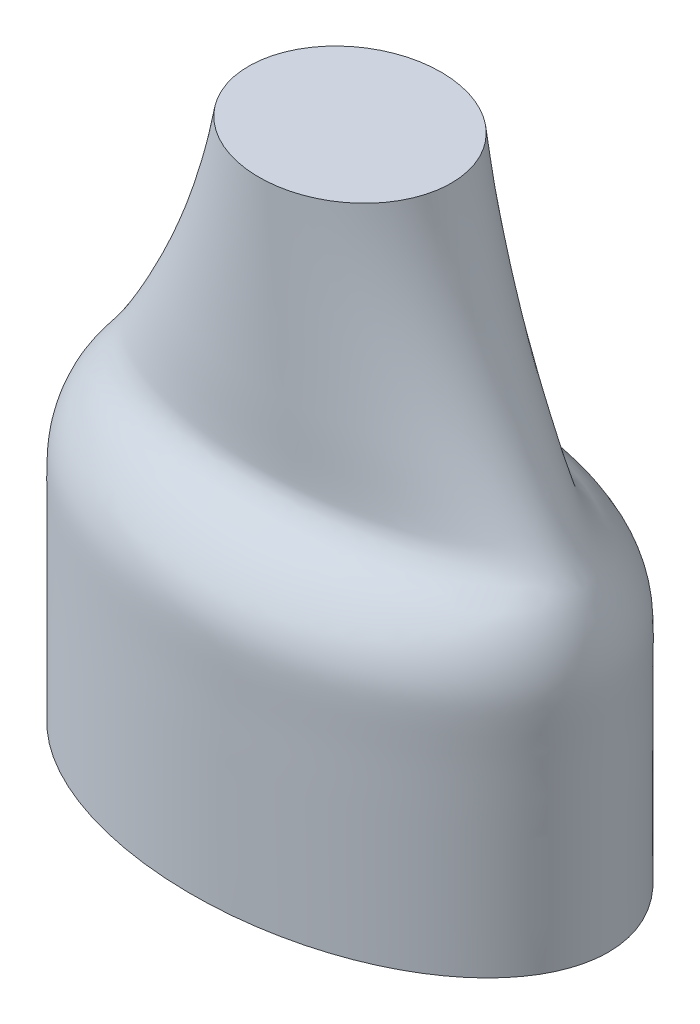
ISO-10303-21;
HEADER;
FILE_DESCRIPTION(('STEP AP214'),'2;1');
FILE_NAME('part.step','',(''),(''),'','','');
FILE_SCHEMA(('AUTOMOTIVE_DESIGN { 1 0 10303 214 1 1 1 1 }'));
ENDSEC;
DATA;
#1=APPLICATION_CONTEXT('core data for automotive mechanical design processes');
#2=APPLICATION_PROTOCOL_DEFINITION('international standard','automotive_design',2000,#1);
#3=PRODUCT_CONTEXT('',#1,'mechanical');
#4=PRODUCT('Part','Part','',(#3));
#5=PRODUCT_RELATED_PRODUCT_CATEGORY('part','',(#4));
#6=PRODUCT_DEFINITION_FORMATION('','',#4);
#7=PRODUCT_DEFINITION_CONTEXT('part definition',#1,'design');
#8=PRODUCT_DEFINITION('design','',#6,#7);
#9=PRODUCT_DEFINITION_SHAPE('','',#8);
#10=(LENGTH_UNIT() NAMED_UNIT(*) SI_UNIT(.MILLI.,.METRE.));
#11=(NAMED_UNIT(*) PLANE_ANGLE_UNIT() SI_UNIT($,.RADIAN.));
#12=(NAMED_UNIT(*) SI_UNIT($,.STERADIAN.) SOLID_ANGLE_UNIT());
#13=UNCERTAINTY_MEASURE_WITH_UNIT(LENGTH_MEASURE(1.E-05),#10,'distance_accuracy_value','');
#14=(GEOMETRIC_REPRESENTATION_CONTEXT(3) GLOBAL_UNCERTAINTY_ASSIGNED_CONTEXT((#13)) GLOBAL_UNIT_ASSIGNED_CONTEXT((#10,
#11,#12)) REPRESENTATION_CONTEXT('',''));
#15=CARTESIAN_POINT('',(0.,0.,0.));
#16=DIRECTION('',(0.,0.,1.));
#17=DIRECTION('',(1.,0.,0.));
#18=AXIS2_PLACEMENT_3D('',#15,#16,#17);
#19=CARTESIAN_POINT('',(0.,140.492925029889,0.));
#20=DIRECTION('',(0.,1.,0.));
#21=DIRECTION('',(0.,0.,1.));
#22=AXIS2_PLACEMENT_3D('',#19,#20,#21);
#23=PLANE('',#22);
#24=CARTESIAN_POINT('',(0.,140.492925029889,0.));
#25=DIRECTION('',(0.,1.,0.));
#26=DIRECTION('',(1.,0.,0.));
#27=AXIS2_PLACEMENT_3D('',#24,#25,#26);
#28=ELLIPSE('',#27,24.2293298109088,21.7798468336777);
#29=CARTESIAN_POINT('',(24.2293298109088,140.492925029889,0.));
#30=VERTEX_POINT('',#29);
#31=EDGE_CURVE('E80',#30,#30,#28,.T.);
#32=ORIENTED_EDGE('',*,*,#31,.T.);
#33=EDGE_LOOP('',(#32));
#34=FACE_BOUND('',#33,.T.);
#35=ADVANCED_FACE('F71',(#34),#23,.T.);
#36=CARTESIAN_POINT('',(0.,0.,0.));
#37=DIRECTION('',(0.,1.,0.));
#38=DIRECTION('',(0.,0.,1.));
#39=AXIS2_PLACEMENT_3D('',#36,#37,#38);
#40=PLANE('',#39);
#41=CARTESIAN_POINT('',(0.,0.,0.));
#42=DIRECTION('',(0.,1.,0.));
#43=DIRECTION('',(1.,0.,0.));
#44=AXIS2_PLACEMENT_3D('',#41,#42,#43);
#45=ELLIPSE('',#44,61.798753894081,37.8626168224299);
#46=CARTESIAN_POINT('',(61.798753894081,0.,0.));
#47=VERTEX_POINT('',#46);
#48=EDGE_CURVE('E12',#47,#47,#45,.T.);
#49=ORIENTED_EDGE('',*,*,#48,.F.);
#50=EDGE_LOOP('',(#49));
#51=FACE_BOUND('',#50,.T.);
#52=ADVANCED_FACE('F73',(#51),#40,.F.);
#53=CARTESIAN_POINT('',(61.7987538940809,0.,0.));
#54=CARTESIAN_POINT('',(61.7987598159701,1.67638472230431,0.));
#55=CARTESIAN_POINT('',(61.7987716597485,5.02915416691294,0.));
#56=CARTESIAN_POINT('',(61.7986659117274,11.0162448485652,0.));
#57=CARTESIAN_POINT('',(61.7993659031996,18.6797052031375,0.));
#58=CARTESIAN_POINT('',(61.7960893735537,27.3011745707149,0.));
#59=CARTESIAN_POINT('',(61.8071526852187,36.6408247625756,0.));
#60=CARTESIAN_POINT('',(61.761224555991,45.2630966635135,0.));
#61=CARTESIAN_POINT('',(61.8830361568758,52.5550394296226,-1.61329283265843E-13));
#62=CARTESIAN_POINT('',(61.6650314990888,57.541237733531,1.59594559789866E-13));
#63=CARTESIAN_POINT('',(61.197541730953,60.1421942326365,-1.00613961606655E-13));
#64=CARTESIAN_POINT('',(60.6240896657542,62.5306847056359,0.));
#65=CARTESIAN_POINT('',(59.9253842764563,64.7632755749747,0.));
#66=CARTESIAN_POINT('',(58.9863064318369,66.9856113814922,0.));
#67=CARTESIAN_POINT('',(57.9352413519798,69.1022821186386,0.));
#68=CARTESIAN_POINT('',(56.75268182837,71.1374751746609,0.));
#69=CARTESIAN_POINT('',(55.3116893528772,73.109372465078,0.));
#70=CARTESIAN_POINT('',(54.2528990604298,74.4552329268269,0.));
#71=CARTESIAN_POINT('',(53.3475663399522,75.664378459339,0.));
#72=CARTESIAN_POINT('',(52.409454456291,76.9581699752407,0.));
#73=CARTESIAN_POINT('',(51.3727540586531,78.4565504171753,0.));
#74=CARTESIAN_POINT('',(50.5031087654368,79.763525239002,0.));
#75=CARTESIAN_POINT('',(47.7489106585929,84.0831314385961,0.));
#76=CARTESIAN_POINT('',(43.8663301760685,90.706127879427,0.));
#77=CARTESIAN_POINT('',(38.6464968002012,100.732033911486,0.));
#78=CARTESIAN_POINT('',(34.3593078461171,110.147572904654,0.));
#79=CARTESIAN_POINT('',(30.221228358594,120.650459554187,0.));
#80=CARTESIAN_POINT('',(27.4350925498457,128.989812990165,0.));
#81=CARTESIAN_POINT('',(25.41711556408,135.925313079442,0.));
#82=CARTESIAN_POINT('',(24.6244220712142,138.973603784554,0.));
#83=CARTESIAN_POINT('',(24.2293298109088,140.492925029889,0.));
#84=CARTESIAN_POINT('',(61.798753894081,0.,-10.0415061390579));
#85=CARTESIAN_POINT('',(61.7987598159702,1.67638472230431,-10.0415083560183));
#86=CARTESIAN_POINT('',(61.7987716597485,5.02915416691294,-10.0415127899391));
#87=CARTESIAN_POINT('',(61.7986659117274,11.0162448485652,-10.0414732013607));
#88=CARTESIAN_POINT('',(61.7993659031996,18.6797052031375,-10.0417352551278));
#89=CARTESIAN_POINT('',(61.7960893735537,27.3011745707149,-10.0405086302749));
#90=CARTESIAN_POINT('',(61.8071526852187,36.6408247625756,-10.0446503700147));
#91=CARTESIAN_POINT('',(61.761224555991,45.2630966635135,-10.0274563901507));
#92=CARTESIAN_POINT('',(61.8830361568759,52.5550394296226,-10.0730586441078));
#93=CARTESIAN_POINT('',(61.6650314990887,57.541237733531,-9.99144487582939));
#94=CARTESIAN_POINT('',(61.197541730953,60.1421942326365,-9.81343956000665));
#95=CARTESIAN_POINT('',(60.6240896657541,62.5306847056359,-9.59053047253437));
#96=CARTESIAN_POINT('',(59.9253842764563,64.7632755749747,-9.31682326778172));
#97=CARTESIAN_POINT('',(58.9863064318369,66.9856113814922,-8.92213128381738));
#98=CARTESIAN_POINT('',(57.9352413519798,69.1022821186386,-8.47940372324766));
#99=CARTESIAN_POINT('',(56.75268182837,71.1374751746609,-7.80629583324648));
#100=CARTESIAN_POINT('',(55.3116893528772,73.109372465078,-7.44454091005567));
#101=CARTESIAN_POINT('',(54.2528990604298,74.4552329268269,-6.81328031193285));
#102=CARTESIAN_POINT('',(53.3475663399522,75.664378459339,-6.51194632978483));
#103=CARTESIAN_POINT('',(52.409454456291,76.9581699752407,-6.27048521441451));
#104=CARTESIAN_POINT('',(51.3727540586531,78.4565504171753,-6.1063891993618));
#105=CARTESIAN_POINT('',(50.5031087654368,79.763525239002,-6.02380434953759));
#106=CARTESIAN_POINT('',(47.7489106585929,84.0831314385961,-5.97454618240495));
#107=CARTESIAN_POINT('',(43.8663301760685,90.706127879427,-6.02174323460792));
#108=CARTESIAN_POINT('',(38.6464968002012,100.732033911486,-6.00663772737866));
#109=CARTESIAN_POINT('',(34.3593078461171,110.147572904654,-6.01112267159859));
#110=CARTESIAN_POINT('',(30.221228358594,120.650459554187,-6.01004761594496));
#111=CARTESIAN_POINT('',(27.4350925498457,128.989812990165,-6.01033973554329));
#112=CARTESIAN_POINT('',(25.41711556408,135.925313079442,-6.0103080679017));
#113=CARTESIAN_POINT('',(24.6244220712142,138.973603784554,-6.01031081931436));
#114=CARTESIAN_POINT('',(24.2293298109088,140.492925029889,-6.01031219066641));
#115=CARTESIAN_POINT('',(55.2875044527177,0.,-19.6724960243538));
#116=CARTESIAN_POINT('',(55.2875097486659,1.67638472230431,-19.6725003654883));
#117=CARTESIAN_POINT('',(55.2875203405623,5.02915416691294,-19.6725090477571));
#118=CARTESIAN_POINT('',(55.287425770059,11.0162448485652,-19.6724315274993));
#119=CARTESIAN_POINT('',(55.2880517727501,18.6797052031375,-19.6729446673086));
#120=CARTESIAN_POINT('',(55.2851215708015,27.3011745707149,-19.6705427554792));
#121=CARTESIAN_POINT('',(55.2950154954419,36.6408247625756,-19.6786528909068));
#122=CARTESIAN_POINT('',(55.2539419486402,45.2630966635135,-19.6449845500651));
#123=CARTESIAN_POINT('',(55.3628781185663,52.5550394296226,-19.7342804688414));
#124=CARTESIAN_POINT('',(55.1679164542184,57.541237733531,-19.5744687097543));
#125=CARTESIAN_POINT('',(54.7495436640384,60.1421942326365,-19.2255857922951));
#126=CARTESIAN_POINT('',(54.2367840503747,62.5306847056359,-18.7891739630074));
#127=CARTESIAN_POINT('',(53.6085466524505,64.7632755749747,-18.2495563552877));
#128=CARTESIAN_POINT('',(52.7777702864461,66.9856113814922,-17.4863907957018));
#129=CARTESIAN_POINT('',(51.8159372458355,69.1022821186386,-16.5958596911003));
#130=CARTESIAN_POINT('',(50.9571283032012,71.1374751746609,-15.4917317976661));
#131=CARTESIAN_POINT('',(49.0503241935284,73.109372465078,-14.117562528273));
#132=CARTESIAN_POINT('',(48.1844665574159,74.4552329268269,-12.9955536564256));
#133=CARTESIAN_POINT('',(47.3668402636,75.664378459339,-12.4062642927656));
#134=CARTESIAN_POINT('',(46.5396759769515,76.9581699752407,-11.9524505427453));
#135=CARTESIAN_POINT('',(45.6176071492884,78.4565504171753,-11.6380555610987));
#136=CARTESIAN_POINT('',(44.8457471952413,79.763525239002,-11.4810542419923));
#137=CARTESIAN_POINT('',(42.3998599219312,84.0831314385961,-11.3869334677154));
#138=CARTESIAN_POINT('',(38.9524197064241,90.706127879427,-11.4771159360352));
#139=CARTESIAN_POINT('',(34.3172517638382,100.732033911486,-11.4482528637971));
#140=CARTESIAN_POINT('',(30.5103389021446,110.147572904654,-11.4568225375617));
#141=CARTESIAN_POINT('',(26.8358074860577,120.650459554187,-11.4547683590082));
#142=CARTESIAN_POINT('',(24.3617793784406,128.989812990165,-11.4553265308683));
#143=CARTESIAN_POINT('',(22.569858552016,135.925313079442,-11.4552660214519));
#144=CARTESIAN_POINT('',(21.8659635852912,138.973603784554,-11.4552712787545));
#145=CARTESIAN_POINT('',(21.515130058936,140.492925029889,-11.4552738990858));
#146=CARTESIAN_POINT('',(32.1091314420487,0.,-33.8733301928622));
#147=CARTESIAN_POINT('',(32.1091345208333,1.67638472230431,-33.8733376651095));
#148=CARTESIAN_POINT('',(32.1091406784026,5.02915416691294,-33.8733526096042));
#149=CARTESIAN_POINT('',(32.109085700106,11.0162448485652,-33.8732191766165));
#150=CARTESIAN_POINT('',(32.1094496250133,18.6797052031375,-33.8741024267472));
#151=CARTESIAN_POINT('',(32.1077461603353,27.3011745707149,-33.8699680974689));
#152=CARTESIAN_POINT('',(32.1134979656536,36.6408247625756,-33.8839277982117));
#153=CARTESIAN_POINT('',(32.0896199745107,45.2630966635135,-33.8259756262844));
#154=CARTESIAN_POINT('',(32.1529497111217,52.5550394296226,-33.9796776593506));
#155=CARTESIAN_POINT('',(32.0396092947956,57.541237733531,-33.7045991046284));
#156=CARTESIAN_POINT('',(31.79684593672,60.1421942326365,-33.1036909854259));
#157=CARTESIAN_POINT('',(31.4986332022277,62.5306847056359,-32.3526026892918));
#158=CARTESIAN_POINT('',(31.1386208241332,64.7632755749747,-31.4193755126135));
#159=CARTESIAN_POINT('',(30.6417302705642,66.9856113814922,-30.1174338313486));
#160=CARTESIAN_POINT('',(30.1162370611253,69.1022821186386,-28.5561932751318));
#161=CARTESIAN_POINT('',(29.3109476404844,71.1374751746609,-26.913057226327));
#162=CARTESIAN_POINT('',(29.154160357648,73.109372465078,-23.7467253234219));
#163=CARTESIAN_POINT('',(28.526051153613,74.4552329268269,-21.9527133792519));
#164=CARTESIAN_POINT('',(28.0630237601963,75.664378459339,-20.9393122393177));
#165=CARTESIAN_POINT('',(27.5640016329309,76.9581699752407,-20.1810400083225));
#166=CARTESIAN_POINT('',(27.0201796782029,78.4565504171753,-19.6482190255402));
#167=CARTESIAN_POINT('',(26.5624318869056,79.763525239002,-19.3836469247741));
#168=CARTESIAN_POINT('',(25.1140495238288,84.0831314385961,-19.2244480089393));
#169=CARTESIAN_POINT('',(23.071777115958,90.706127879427,-19.3769855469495));
#170=CARTESIAN_POINT('',(20.3264306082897,100.732033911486,-19.3281656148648));
#171=CARTESIAN_POINT('',(18.0715323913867,110.147572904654,-19.3426606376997));
#172=CARTESIAN_POINT('',(15.8950829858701,120.650459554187,-19.3391861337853));
#173=CARTESIAN_POINT('',(14.4296927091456,128.989812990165,-19.3401302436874));
#174=CARTESIAN_POINT('',(13.368322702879,135.925313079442,-19.3400278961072));
#175=CARTESIAN_POINT('',(12.951399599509,138.973603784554,-19.3400367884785));
#176=CARTESIAN_POINT('',(12.7435978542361,140.492925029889,-19.3400412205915));
#177=CARTESIAN_POINT('',(16.3895847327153,0.,-37.8626168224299));
#178=CARTESIAN_POINT('',(16.3895863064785,1.67638472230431,-37.862625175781));
#179=CARTESIAN_POINT('',(16.3895894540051,5.02915416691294,-37.8626418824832));
#180=CARTESIAN_POINT('',(16.3895613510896,11.0162448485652,-37.8624927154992));
#181=CARTESIAN_POINT('',(16.3897473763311,18.6797052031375,-37.8634801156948));
#182=CARTESIAN_POINT('',(16.3888766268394,27.3011745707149,-37.8588582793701));
#183=CARTESIAN_POINT('',(16.391816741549,36.6408247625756,-37.8744640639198));
#184=CARTESIAN_POINT('',(16.3796111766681,45.2630966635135,-37.8096783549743));
#185=CARTESIAN_POINT('',(16.4119830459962,52.5550394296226,-37.98150444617));
#186=CARTESIAN_POINT('',(16.3540475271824,57.541237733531,-37.6739894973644));
#187=CARTESIAN_POINT('',(16.2302889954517,60.1421942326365,-37.0023878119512));
#188=CARTESIAN_POINT('',(16.077764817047,62.5306847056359,-36.1626945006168));
#189=CARTESIAN_POINT('',(15.8975448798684,64.7632755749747,-35.1212812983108));
#190=CARTESIAN_POINT('',(15.6333878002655,66.9856113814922,-33.6608952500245));
#191=CARTESIAN_POINT('',(15.3893561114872,69.1022821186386,-31.927540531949));
#192=CARTESIAN_POINT('',(14.7542748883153,71.1374751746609,-29.9820646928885));
#193=CARTESIAN_POINT('',(15.3690460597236,73.109372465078,-26.7803366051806));
#194=CARTESIAN_POINT('',(14.9568951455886,74.4552329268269,-24.7168659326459));
#195=CARTESIAN_POINT('',(14.7291913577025,75.664378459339,-23.5835784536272));
#196=CARTESIAN_POINT('',(14.4608550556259,76.9581699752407,-22.7262472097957));
#197=CARTESIAN_POINT('',(14.1771924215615,78.4565504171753,-22.1270803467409));
#198=CARTESIAN_POINT('',(13.9366155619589,79.763525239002,-21.8289188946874));
#199=CARTESIAN_POINT('',(13.176925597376,84.0831314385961,-21.6497630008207));
#200=CARTESIAN_POINT('',(12.1051614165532,90.706127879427,-21.8214224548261));
#201=CARTESIAN_POINT('',(10.664817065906,100.732033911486,-21.7664825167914));
#202=CARTESIAN_POINT('',(9.48170307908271,110.147572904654,-21.7827946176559));
#203=CARTESIAN_POINT('',(8.33977666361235,120.650459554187,-21.7788845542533));
#204=CARTESIAN_POINT('',(7.57091949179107,128.989812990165,-21.7799470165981));
#205=CARTESIAN_POINT('',(7.01404382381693,135.925313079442,-21.7798318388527));
#206=CARTESIAN_POINT('',(6.795294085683,138.973603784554,-21.7798418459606));
#207=CARTESIAN_POINT('',(6.68626540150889,140.492925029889,-21.7798468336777));
#208=CARTESIAN_POINT('',(-16.3895847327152,0.,-37.8626168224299));
#209=CARTESIAN_POINT('',(-16.3895863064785,1.67638472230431,-37.862625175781));
#210=CARTESIAN_POINT('',(-16.389589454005,5.02915416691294,-37.8626418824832));
#211=CARTESIAN_POINT('',(-16.3895613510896,11.0162448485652,-37.8624927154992));
#212=CARTESIAN_POINT('',(-16.3897473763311,18.6797052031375,-37.8634801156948));
#213=CARTESIAN_POINT('',(-16.3888766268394,27.3011745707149,-37.8588582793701));
#214=CARTESIAN_POINT('',(-16.391816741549,36.6408247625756,-37.8744640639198));
#215=CARTESIAN_POINT('',(-16.3796111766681,45.2630966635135,-37.8096783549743));
#216=CARTESIAN_POINT('',(-16.4119830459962,52.5550394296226,-37.98150444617));
#217=CARTESIAN_POINT('',(-16.3540475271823,57.541237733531,-37.6739894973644));
#218=CARTESIAN_POINT('',(-16.2302889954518,60.1421942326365,-37.0023878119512));
#219=CARTESIAN_POINT('',(-16.0777648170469,62.5306847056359,-36.1626945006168));
#220=CARTESIAN_POINT('',(-15.8975448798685,64.7632755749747,-35.1212812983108));
#221=CARTESIAN_POINT('',(-15.6333878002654,66.9856113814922,-33.6608952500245));
#222=CARTESIAN_POINT('',(-15.3893561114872,69.1022821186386,-31.927540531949));
#223=CARTESIAN_POINT('',(-14.7542748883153,71.1374751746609,-29.9820646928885));
#224=CARTESIAN_POINT('',(-15.3690460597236,73.109372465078,-26.7803366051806));
#225=CARTESIAN_POINT('',(-14.9568951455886,74.4552329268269,-24.7168659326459));
#226=CARTESIAN_POINT('',(-14.7291913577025,75.664378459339,-23.5835784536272));
#227=CARTESIAN_POINT('',(-14.4608550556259,76.9581699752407,-22.7262472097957));
#228=CARTESIAN_POINT('',(-14.1771924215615,78.4565504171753,-22.1270803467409));
#229=CARTESIAN_POINT('',(-13.9366155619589,79.763525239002,-21.8289188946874));
#230=CARTESIAN_POINT('',(-13.176925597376,84.0831314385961,-21.6497630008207));
#231=CARTESIAN_POINT('',(-12.1051614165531,90.706127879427,-21.8214224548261));
#232=CARTESIAN_POINT('',(-10.664817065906,100.732033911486,-21.7664825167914));
#233=CARTESIAN_POINT('',(-9.48170307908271,110.147572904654,-21.7827946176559));
#234=CARTESIAN_POINT('',(-8.33977666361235,120.650459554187,-21.7788845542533));
#235=CARTESIAN_POINT('',(-7.57091949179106,128.989812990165,-21.7799470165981));
#236=CARTESIAN_POINT('',(-7.01404382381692,135.925313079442,-21.7798318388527));
#237=CARTESIAN_POINT('',(-6.795294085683,138.973603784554,-21.7798418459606));
#238=CARTESIAN_POINT('',(-6.68626540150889,140.492925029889,-21.7798468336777));
#239=CARTESIAN_POINT('',(-32.1091314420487,0.,-33.8733301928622));
#240=CARTESIAN_POINT('',(-32.1091345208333,1.67638472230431,-33.8733376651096));
#241=CARTESIAN_POINT('',(-32.1091406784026,5.02915416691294,-33.8733526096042));
#242=CARTESIAN_POINT('',(-32.1090857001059,11.0162448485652,-33.8732191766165));
#243=CARTESIAN_POINT('',(-32.1094496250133,18.6797052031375,-33.8741024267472));
#244=CARTESIAN_POINT('',(-32.1077461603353,27.3011745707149,-33.8699680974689));
#245=CARTESIAN_POINT('',(-32.1134979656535,36.6408247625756,-33.8839277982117));
#246=CARTESIAN_POINT('',(-32.0896199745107,45.2630966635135,-33.8259756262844));
#247=CARTESIAN_POINT('',(-32.1529497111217,52.5550394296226,-33.9796776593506));
#248=CARTESIAN_POINT('',(-32.0396092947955,57.541237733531,-33.7045991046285));
#249=CARTESIAN_POINT('',(-31.7968459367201,60.1421942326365,-33.1036909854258));
#250=CARTESIAN_POINT('',(-31.4986332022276,62.5306847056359,-32.3526026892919));
#251=CARTESIAN_POINT('',(-31.1386208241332,64.7632755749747,-31.4193755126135));
#252=CARTESIAN_POINT('',(-30.6417302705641,66.9856113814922,-30.1174338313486));
#253=CARTESIAN_POINT('',(-30.1162370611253,69.1022821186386,-28.5561932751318));
#254=CARTESIAN_POINT('',(-29.3109476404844,71.1374751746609,-26.913057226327));
#255=CARTESIAN_POINT('',(-29.154160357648,73.109372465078,-23.7467253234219));
#256=CARTESIAN_POINT('',(-28.526051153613,74.4552329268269,-21.9527133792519));
#257=CARTESIAN_POINT('',(-28.0630237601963,75.664378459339,-20.9393122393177));
#258=CARTESIAN_POINT('',(-27.5640016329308,76.9581699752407,-20.1810400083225));
#259=CARTESIAN_POINT('',(-27.0201796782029,78.4565504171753,-19.6482190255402));
#260=CARTESIAN_POINT('',(-26.5624318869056,79.763525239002,-19.383646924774));
#261=CARTESIAN_POINT('',(-25.1140495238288,84.0831314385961,-19.2244480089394));
#262=CARTESIAN_POINT('',(-23.071777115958,90.706127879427,-19.3769855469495));
#263=CARTESIAN_POINT('',(-20.3264306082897,100.732033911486,-19.3281656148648));
#264=CARTESIAN_POINT('',(-18.0715323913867,110.147572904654,-19.3426606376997));
#265=CARTESIAN_POINT('',(-15.8950829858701,120.650459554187,-19.3391861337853));
#266=CARTESIAN_POINT('',(-14.4296927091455,128.989812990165,-19.3401302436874));
#267=CARTESIAN_POINT('',(-13.368322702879,135.925313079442,-19.3400278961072));
#268=CARTESIAN_POINT('',(-12.951399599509,138.973603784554,-19.3400367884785));
#269=CARTESIAN_POINT('',(-12.7435978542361,140.492925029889,-19.3400412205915));
#270=CARTESIAN_POINT('',(-55.2875044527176,0.,-19.6724960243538));
#271=CARTESIAN_POINT('',(-55.2875097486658,1.67638472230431,-19.6725003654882));
#272=CARTESIAN_POINT('',(-55.2875203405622,5.02915416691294,-19.6725090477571));
#273=CARTESIAN_POINT('',(-55.2874257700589,11.0162448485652,-19.6724315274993));
#274=CARTESIAN_POINT('',(-55.28805177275,18.6797052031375,-19.6729446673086));
#275=CARTESIAN_POINT('',(-55.2851215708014,27.3011745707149,-19.6705427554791));
#276=CARTESIAN_POINT('',(-55.2950154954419,36.6408247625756,-19.6786528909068));
#277=CARTESIAN_POINT('',(-55.2539419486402,45.2630966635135,-19.6449845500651));
#278=CARTESIAN_POINT('',(-55.3628781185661,52.5550394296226,-19.7342804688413));
#279=CARTESIAN_POINT('',(-55.1679164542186,57.541237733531,-19.5744687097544));
#280=CARTESIAN_POINT('',(-54.7495436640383,60.1421942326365,-19.225585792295));
#281=CARTESIAN_POINT('',(-54.2367840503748,62.5306847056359,-18.7891739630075));
#282=CARTESIAN_POINT('',(-53.6085466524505,64.7632755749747,-18.2495563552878));
#283=CARTESIAN_POINT('',(-52.777770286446,66.9856113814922,-17.4863907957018));
#284=CARTESIAN_POINT('',(-51.8159372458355,69.1022821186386,-16.5958596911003));
#285=CARTESIAN_POINT('',(-50.9571283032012,71.1374751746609,-15.4917317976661));
#286=CARTESIAN_POINT('',(-49.0503241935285,73.109372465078,-14.117562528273));
#287=CARTESIAN_POINT('',(-48.1844665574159,74.4552329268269,-12.9955536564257));
#288=CARTESIAN_POINT('',(-47.3668402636,75.664378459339,-12.4062642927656));
#289=CARTESIAN_POINT('',(-46.5396759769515,76.9581699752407,-11.9524505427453));
#290=CARTESIAN_POINT('',(-45.6176071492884,78.4565504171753,-11.6380555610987));
#291=CARTESIAN_POINT('',(-44.8457471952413,79.763525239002,-11.4810542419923));
#292=CARTESIAN_POINT('',(-42.3998599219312,84.0831314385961,-11.3869334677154));
#293=CARTESIAN_POINT('',(-38.9524197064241,90.706127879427,-11.4771159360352));
#294=CARTESIAN_POINT('',(-34.3172517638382,100.732033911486,-11.4482528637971));
#295=CARTESIAN_POINT('',(-30.5103389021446,110.147572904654,-11.4568225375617));
#296=CARTESIAN_POINT('',(-26.8358074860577,120.650459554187,-11.4547683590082));
#297=CARTESIAN_POINT('',(-24.3617793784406,128.989812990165,-11.4553265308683));
#298=CARTESIAN_POINT('',(-22.569858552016,135.925313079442,-11.4552660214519));
#299=CARTESIAN_POINT('',(-21.8659635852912,138.973603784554,-11.4552712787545));
#300=CARTESIAN_POINT('',(-21.515130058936,140.492925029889,-11.4552738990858));
#301=CARTESIAN_POINT('',(-61.7987538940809,0.,-10.0415061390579));
#302=CARTESIAN_POINT('',(-61.7987598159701,1.67638472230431,-10.0415083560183));
#303=CARTESIAN_POINT('',(-61.7987716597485,5.02915416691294,-10.0415127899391));
#304=CARTESIAN_POINT('',(-61.7986659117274,11.0162448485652,-10.0414732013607));
#305=CARTESIAN_POINT('',(-61.7993659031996,18.6797052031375,-10.0417352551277));
#306=CARTESIAN_POINT('',(-61.7960893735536,27.3011745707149,-10.0405086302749));
#307=CARTESIAN_POINT('',(-61.8071526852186,36.6408247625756,-10.0446503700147));
#308=CARTESIAN_POINT('',(-61.761224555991,45.2630966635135,-10.0274563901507));
#309=CARTESIAN_POINT('',(-61.8830361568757,52.5550394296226,-10.0730586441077));
#310=CARTESIAN_POINT('',(-61.6650314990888,57.541237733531,-9.99144487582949));
#311=CARTESIAN_POINT('',(-61.197541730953,60.1421942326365,-9.81343956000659));
#312=CARTESIAN_POINT('',(-60.6240896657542,62.5306847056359,-9.59053047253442));
#313=CARTESIAN_POINT('',(-59.9253842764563,64.7632755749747,-9.31682326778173));
#314=CARTESIAN_POINT('',(-58.9863064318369,66.9856113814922,-8.9221312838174));
#315=CARTESIAN_POINT('',(-57.9352413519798,69.1022821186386,-8.47940372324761));
#316=CARTESIAN_POINT('',(-56.75268182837,71.1374751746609,-7.80629583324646));
#317=CARTESIAN_POINT('',(-55.3116893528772,73.109372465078,-7.44454091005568));
#318=CARTESIAN_POINT('',(-54.2528990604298,74.4552329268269,-6.81328031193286));
#319=CARTESIAN_POINT('',(-53.3475663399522,75.664378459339,-6.51194632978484));
#320=CARTESIAN_POINT('',(-52.409454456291,76.9581699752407,-6.27048521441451));
#321=CARTESIAN_POINT('',(-51.3727540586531,78.4565504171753,-6.10638919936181));
#322=CARTESIAN_POINT('',(-50.5031087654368,79.763525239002,-6.0238043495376));
#323=CARTESIAN_POINT('',(-47.7489106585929,84.0831314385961,-5.97454618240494));
#324=CARTESIAN_POINT('',(-43.8663301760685,90.706127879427,-6.02174323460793));
#325=CARTESIAN_POINT('',(-38.6464968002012,100.732033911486,-6.00663772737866));
#326=CARTESIAN_POINT('',(-34.3593078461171,110.147572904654,-6.0111226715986));
#327=CARTESIAN_POINT('',(-30.221228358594,120.650459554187,-6.01004761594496));
#328=CARTESIAN_POINT('',(-27.4350925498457,128.989812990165,-6.01033973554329));
#329=CARTESIAN_POINT('',(-25.41711556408,135.925313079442,-6.0103080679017));
#330=CARTESIAN_POINT('',(-24.6244220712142,138.973603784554,-6.01031081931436));
#331=CARTESIAN_POINT('',(-24.2293298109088,140.492925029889,-6.01031219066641));
#332=CARTESIAN_POINT('',(-61.7987538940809,0.,10.0415061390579));
#333=CARTESIAN_POINT('',(-61.7987598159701,1.67638472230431,10.0415083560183));
#334=CARTESIAN_POINT('',(-61.7987716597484,5.02915416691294,10.0415127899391));
#335=CARTESIAN_POINT('',(-61.7986659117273,11.0162448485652,10.0414732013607));
#336=CARTESIAN_POINT('',(-61.7993659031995,18.6797052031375,10.0417352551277));
#337=CARTESIAN_POINT('',(-61.7960893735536,27.3011745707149,10.0405086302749));
#338=CARTESIAN_POINT('',(-61.8071526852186,36.6408247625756,10.0446503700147));
#339=CARTESIAN_POINT('',(-61.761224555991,45.2630966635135,10.0274563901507));
#340=CARTESIAN_POINT('',(-61.8830361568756,52.5550394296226,10.0730586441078));
#341=CARTESIAN_POINT('',(-61.6650314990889,57.541237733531,9.99144487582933));
#342=CARTESIAN_POINT('',(-61.1975417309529,60.1421942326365,9.81343956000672));
#343=CARTESIAN_POINT('',(-60.6240896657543,62.5306847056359,9.59053047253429));
#344=CARTESIAN_POINT('',(-59.9253842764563,64.7632755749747,9.31682326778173));
#345=CARTESIAN_POINT('',(-58.986306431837,66.9856113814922,8.92213128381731));
#346=CARTESIAN_POINT('',(-57.9352413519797,69.1022821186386,8.47940372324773));
#347=CARTESIAN_POINT('',(-56.75268182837,71.1374751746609,7.80629583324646));
#348=CARTESIAN_POINT('',(-55.3116893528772,73.109372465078,7.44454091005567));
#349=CARTESIAN_POINT('',(-54.2528990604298,74.4552329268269,6.81328031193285));
#350=CARTESIAN_POINT('',(-53.3475663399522,75.664378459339,6.51194632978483));
#351=CARTESIAN_POINT('',(-52.409454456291,76.9581699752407,6.27048521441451));
#352=CARTESIAN_POINT('',(-51.3727540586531,78.4565504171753,6.10638919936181));
#353=CARTESIAN_POINT('',(-50.5031087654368,79.763525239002,6.02380434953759));
#354=CARTESIAN_POINT('',(-47.7489106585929,84.0831314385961,5.97454618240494));
#355=CARTESIAN_POINT('',(-43.8663301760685,90.706127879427,6.02174323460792));
#356=CARTESIAN_POINT('',(-38.6464968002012,100.732033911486,6.00663772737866));
#357=CARTESIAN_POINT('',(-34.3593078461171,110.147572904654,6.01112267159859));
#358=CARTESIAN_POINT('',(-30.221228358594,120.650459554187,6.01004761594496));
#359=CARTESIAN_POINT('',(-27.4350925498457,128.989812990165,6.01033973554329));
#360=CARTESIAN_POINT('',(-25.41711556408,135.925313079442,6.0103080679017));
#361=CARTESIAN_POINT('',(-24.6244220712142,138.973603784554,6.01031081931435));
#362=CARTESIAN_POINT('',(-24.2293298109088,140.492925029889,6.0103121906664));
#363=CARTESIAN_POINT('',(-55.2875044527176,0.,19.6724960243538));
#364=CARTESIAN_POINT('',(-55.2875097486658,1.67638472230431,19.6725003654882));
#365=CARTESIAN_POINT('',(-55.2875203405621,5.02915416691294,19.6725090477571));
#366=CARTESIAN_POINT('',(-55.2874257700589,11.0162448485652,19.6724315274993));
#367=CARTESIAN_POINT('',(-55.28805177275,18.6797052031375,19.6729446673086));
#368=CARTESIAN_POINT('',(-55.2851215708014,27.3011745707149,19.6705427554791));
#369=CARTESIAN_POINT('',(-55.2950154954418,36.6408247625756,19.6786528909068));
#370=CARTESIAN_POINT('',(-55.2539419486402,45.2630966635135,19.6449845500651));
#371=CARTESIAN_POINT('',(-55.3628781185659,52.5550394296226,19.7342804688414));
#372=CARTESIAN_POINT('',(-55.1679164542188,57.541237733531,19.5744687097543));
#373=CARTESIAN_POINT('',(-54.7495436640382,60.1421942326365,19.2255857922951));
#374=CARTESIAN_POINT('',(-54.2367840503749,62.5306847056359,18.7891739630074));
#375=CARTESIAN_POINT('',(-53.6085466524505,64.7632755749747,18.2495563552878));
#376=CARTESIAN_POINT('',(-52.7777702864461,66.9856113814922,17.4863907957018));
#377=CARTESIAN_POINT('',(-51.8159372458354,69.1022821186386,16.5958596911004));
#378=CARTESIAN_POINT('',(-50.9571283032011,71.1374751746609,15.4917317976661));
#379=CARTESIAN_POINT('',(-49.0503241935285,73.109372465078,14.117562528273));
#380=CARTESIAN_POINT('',(-48.1844665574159,74.4552329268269,12.9955536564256));
#381=CARTESIAN_POINT('',(-47.3668402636,75.664378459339,12.4062642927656));
#382=CARTESIAN_POINT('',(-46.5396759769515,76.9581699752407,11.9524505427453));
#383=CARTESIAN_POINT('',(-45.6176071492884,78.4565504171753,11.6380555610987));
#384=CARTESIAN_POINT('',(-44.8457471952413,79.763525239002,11.4810542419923));
#385=CARTESIAN_POINT('',(-42.3998599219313,84.0831314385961,11.3869334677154));
#386=CARTESIAN_POINT('',(-38.9524197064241,90.706127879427,11.4771159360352));
#387=CARTESIAN_POINT('',(-34.3172517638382,100.732033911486,11.4482528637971));
#388=CARTESIAN_POINT('',(-30.5103389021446,110.147572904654,11.4568225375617));
#389=CARTESIAN_POINT('',(-26.8358074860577,120.650459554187,11.4547683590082));
#390=CARTESIAN_POINT('',(-24.3617793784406,128.989812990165,11.4553265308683));
#391=CARTESIAN_POINT('',(-22.5698585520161,135.925313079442,11.4552660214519));
#392=CARTESIAN_POINT('',(-21.8659635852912,138.973603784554,11.4552712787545));
#393=CARTESIAN_POINT('',(-21.515130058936,140.492925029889,11.4552738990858));
#394=CARTESIAN_POINT('',(-32.1091314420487,0.,33.8733301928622));
#395=CARTESIAN_POINT('',(-32.1091345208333,1.67638472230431,33.8733376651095));
#396=CARTESIAN_POINT('',(-32.1091406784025,5.02915416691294,33.8733526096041));
#397=CARTESIAN_POINT('',(-32.1090857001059,11.0162448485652,33.8732191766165));
#398=CARTESIAN_POINT('',(-32.1094496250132,18.6797052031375,33.8741024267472));
#399=CARTESIAN_POINT('',(-32.1077461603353,27.3011745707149,33.8699680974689));
#400=CARTESIAN_POINT('',(-32.1134979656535,36.6408247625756,33.8839277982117));
#401=CARTESIAN_POINT('',(-32.0896199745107,45.2630966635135,33.8259756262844));
#402=CARTESIAN_POINT('',(-32.1529497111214,52.5550394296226,33.9796776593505));
#403=CARTESIAN_POINT('',(-32.0396092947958,57.541237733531,33.7045991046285));
#404=CARTESIAN_POINT('',(-31.7968459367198,60.1421942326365,33.1036909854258));
#405=CARTESIAN_POINT('',(-31.4986332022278,62.5306847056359,32.3526026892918));
#406=CARTESIAN_POINT('',(-31.1386208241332,64.7632755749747,31.4193755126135));
#407=CARTESIAN_POINT('',(-30.6417302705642,66.9856113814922,30.1174338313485));
#408=CARTESIAN_POINT('',(-30.1162370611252,69.1022821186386,28.5561932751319));
#409=CARTESIAN_POINT('',(-29.3109476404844,71.1374751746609,26.913057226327));
#410=CARTESIAN_POINT('',(-29.154160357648,73.109372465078,23.7467253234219));
#411=CARTESIAN_POINT('',(-28.526051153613,74.4552329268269,21.9527133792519));
#412=CARTESIAN_POINT('',(-28.0630237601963,75.664378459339,20.9393122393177));
#413=CARTESIAN_POINT('',(-27.5640016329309,76.9581699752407,20.1810400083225));
#414=CARTESIAN_POINT('',(-27.0201796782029,78.4565504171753,19.6482190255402));
#415=CARTESIAN_POINT('',(-26.5624318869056,79.763525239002,19.383646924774));
#416=CARTESIAN_POINT('',(-25.1140495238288,84.0831314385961,19.2244480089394));
#417=CARTESIAN_POINT('',(-23.071777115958,90.706127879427,19.3769855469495));
#418=CARTESIAN_POINT('',(-20.3264306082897,100.732033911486,19.3281656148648));
#419=CARTESIAN_POINT('',(-18.0715323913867,110.147572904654,19.3426606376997));
#420=CARTESIAN_POINT('',(-15.8950829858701,120.650459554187,19.3391861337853));
#421=CARTESIAN_POINT('',(-14.4296927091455,128.989812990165,19.3401302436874));
#422=CARTESIAN_POINT('',(-13.368322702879,135.925313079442,19.3400278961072));
#423=CARTESIAN_POINT('',(-12.951399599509,138.973603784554,19.3400367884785));
#424=CARTESIAN_POINT('',(-12.7435978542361,140.492925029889,19.3400412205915));
#425=CARTESIAN_POINT('',(-16.3895847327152,0.,37.8626168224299));
#426=CARTESIAN_POINT('',(-16.3895863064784,1.67638472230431,37.862625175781));
#427=CARTESIAN_POINT('',(-16.389589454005,5.02915416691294,37.8626418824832));
#428=CARTESIAN_POINT('',(-16.3895613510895,11.0162448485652,37.8624927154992));
#429=CARTESIAN_POINT('',(-16.389747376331,18.6797052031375,37.8634801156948));
#430=CARTESIAN_POINT('',(-16.3888766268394,27.3011745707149,37.85885827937));
#431=CARTESIAN_POINT('',(-16.3918167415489,36.6408247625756,37.8744640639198));
#432=CARTESIAN_POINT('',(-16.3796111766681,45.2630966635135,37.8096783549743));
#433=CARTESIAN_POINT('',(-16.4119830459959,52.5550394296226,37.9815044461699));
#434=CARTESIAN_POINT('',(-16.3540475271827,57.541237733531,37.6739894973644));
#435=CARTESIAN_POINT('',(-16.2302889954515,60.1421942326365,37.0023878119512));
#436=CARTESIAN_POINT('',(-16.0777648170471,62.5306847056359,36.1626945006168));
#437=CARTESIAN_POINT('',(-15.8975448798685,64.7632755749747,35.1212812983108));
#438=CARTESIAN_POINT('',(-15.6333878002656,66.9856113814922,33.6608952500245));
#439=CARTESIAN_POINT('',(-15.3893561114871,69.1022821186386,31.927540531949));
#440=CARTESIAN_POINT('',(-14.7542748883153,71.1374751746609,29.9820646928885));
#441=CARTESIAN_POINT('',(-15.3690460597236,73.109372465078,26.7803366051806));
#442=CARTESIAN_POINT('',(-14.9568951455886,74.4552329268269,24.7168659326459));
#443=CARTESIAN_POINT('',(-14.7291913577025,75.664378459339,23.5835784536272));
#444=CARTESIAN_POINT('',(-14.4608550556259,76.9581699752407,22.7262472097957));
#445=CARTESIAN_POINT('',(-14.1771924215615,78.4565504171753,22.1270803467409));
#446=CARTESIAN_POINT('',(-13.9366155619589,79.763525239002,21.8289188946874));
#447=CARTESIAN_POINT('',(-13.176925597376,84.0831314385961,21.6497630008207));
#448=CARTESIAN_POINT('',(-12.1051614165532,90.706127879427,21.8214224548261));
#449=CARTESIAN_POINT('',(-10.664817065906,100.732033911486,21.7664825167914));
#450=CARTESIAN_POINT('',(-9.48170307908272,110.147572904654,21.7827946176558));
#451=CARTESIAN_POINT('',(-8.33977666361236,120.650459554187,21.7788845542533));
#452=CARTESIAN_POINT('',(-7.57091949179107,128.989812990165,21.7799470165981));
#453=CARTESIAN_POINT('',(-7.01404382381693,135.925313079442,21.7798318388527));
#454=CARTESIAN_POINT('',(-6.79529408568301,138.973603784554,21.7798418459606));
#455=CARTESIAN_POINT('',(-6.6862654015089,140.492925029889,21.7798468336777));
#456=CARTESIAN_POINT('',(16.3895847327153,0.,37.8626168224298));
#457=CARTESIAN_POINT('',(16.3895863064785,1.67638472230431,37.8626251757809));
#458=CARTESIAN_POINT('',(16.3895894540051,5.02915416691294,37.8626418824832));
#459=CARTESIAN_POINT('',(16.3895613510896,11.0162448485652,37.8624927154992));
#460=CARTESIAN_POINT('',(16.3897473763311,18.6797052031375,37.8634801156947));
#461=CARTESIAN_POINT('',(16.3888766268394,27.3011745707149,37.85885827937));
#462=CARTESIAN_POINT('',(16.391816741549,36.6408247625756,37.8744640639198));
#463=CARTESIAN_POINT('',(16.379611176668,45.2630966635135,37.8096783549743));
#464=CARTESIAN_POINT('',(16.4119830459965,52.5550394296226,37.9815044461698));
#465=CARTESIAN_POINT('',(16.3540475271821,57.541237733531,37.6739894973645));
#466=CARTESIAN_POINT('',(16.2302889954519,60.1421942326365,37.0023878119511));
#467=CARTESIAN_POINT('',(16.0777648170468,62.5306847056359,36.1626945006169));
#468=CARTESIAN_POINT('',(15.8975448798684,64.7632755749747,35.1212812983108));
#469=CARTESIAN_POINT('',(15.6333878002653,66.9856113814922,33.6608952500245));
#470=CARTESIAN_POINT('',(15.3893561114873,69.1022821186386,31.927540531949));
#471=CARTESIAN_POINT('',(14.7542748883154,71.1374751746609,29.9820646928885));
#472=CARTESIAN_POINT('',(15.3690460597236,73.109372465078,26.7803366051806));
#473=CARTESIAN_POINT('',(14.9568951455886,74.4552329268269,24.7168659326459));
#474=CARTESIAN_POINT('',(14.7291913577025,75.664378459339,23.5835784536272));
#475=CARTESIAN_POINT('',(14.4608550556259,76.9581699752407,22.7262472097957));
#476=CARTESIAN_POINT('',(14.1771924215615,78.4565504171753,22.1270803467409));
#477=CARTESIAN_POINT('',(13.9366155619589,79.763525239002,21.8289188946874));
#478=CARTESIAN_POINT('',(13.176925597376,84.0831314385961,21.6497630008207));
#479=CARTESIAN_POINT('',(12.1051614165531,90.706127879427,21.8214224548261));
#480=CARTESIAN_POINT('',(10.664817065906,100.732033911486,21.7664825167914));
#481=CARTESIAN_POINT('',(9.4817030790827,110.147572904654,21.7827946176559));
#482=CARTESIAN_POINT('',(8.33977666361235,120.650459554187,21.7788845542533));
#483=CARTESIAN_POINT('',(7.57091949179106,128.989812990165,21.7799470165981));
#484=CARTESIAN_POINT('',(7.01404382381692,135.925313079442,21.7798318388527));
#485=CARTESIAN_POINT('',(6.79529408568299,138.973603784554,21.7798418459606));
#486=CARTESIAN_POINT('',(6.68626540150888,140.492925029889,21.7798468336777));
#487=CARTESIAN_POINT('',(32.1091314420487,0.,33.8733301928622));
#488=CARTESIAN_POINT('',(32.1091345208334,1.67638472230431,33.8733376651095));
#489=CARTESIAN_POINT('',(32.1091406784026,5.02915416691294,33.8733526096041));
#490=CARTESIAN_POINT('',(32.109085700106,11.0162448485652,33.8732191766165));
#491=CARTESIAN_POINT('',(32.1094496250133,18.6797052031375,33.8741024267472));
#492=CARTESIAN_POINT('',(32.1077461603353,27.3011745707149,33.8699680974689));
#493=CARTESIAN_POINT('',(32.1134979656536,36.6408247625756,33.8839277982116));
#494=CARTESIAN_POINT('',(32.0896199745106,45.2630966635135,33.8259756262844));
#495=CARTESIAN_POINT('',(32.1529497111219,52.5550394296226,33.9796776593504));
#496=CARTESIAN_POINT('',(32.0396092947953,57.541237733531,33.7045991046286));
#497=CARTESIAN_POINT('',(31.7968459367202,60.1421942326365,33.1036909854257));
#498=CARTESIAN_POINT('',(31.4986332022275,62.5306847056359,32.3526026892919));
#499=CARTESIAN_POINT('',(31.1386208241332,64.7632755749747,31.4193755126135));
#500=CARTESIAN_POINT('',(30.641730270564,66.9856113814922,30.1174338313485));
#501=CARTESIAN_POINT('',(30.1162370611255,69.1022821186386,28.5561932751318));
#502=CARTESIAN_POINT('',(29.3109476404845,71.1374751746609,26.913057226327));
#503=CARTESIAN_POINT('',(29.154160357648,73.109372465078,23.7467253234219));
#504=CARTESIAN_POINT('',(28.526051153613,74.4552329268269,21.9527133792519));
#505=CARTESIAN_POINT('',(28.0630237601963,75.664378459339,20.9393122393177));
#506=CARTESIAN_POINT('',(27.5640016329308,76.9581699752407,20.1810400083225));
#507=CARTESIAN_POINT('',(27.0201796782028,78.4565504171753,19.6482190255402));
#508=CARTESIAN_POINT('',(26.5624318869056,79.763525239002,19.3836469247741));
#509=CARTESIAN_POINT('',(25.1140495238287,84.0831314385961,19.2244480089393));
#510=CARTESIAN_POINT('',(23.071777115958,90.706127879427,19.3769855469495));
#511=CARTESIAN_POINT('',(20.3264306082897,100.732033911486,19.3281656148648));
#512=CARTESIAN_POINT('',(18.0715323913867,110.147572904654,19.3426606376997));
#513=CARTESIAN_POINT('',(15.8950829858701,120.650459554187,19.3391861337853));
#514=CARTESIAN_POINT('',(14.4296927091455,128.989812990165,19.3401302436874));
#515=CARTESIAN_POINT('',(13.368322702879,135.925313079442,19.3400278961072));
#516=CARTESIAN_POINT('',(12.951399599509,138.973603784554,19.3400367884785));
#517=CARTESIAN_POINT('',(12.7435978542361,140.492925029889,19.3400412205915));
#518=CARTESIAN_POINT('',(55.2875044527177,0.,19.6724960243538));
#519=CARTESIAN_POINT('',(55.2875097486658,1.67638472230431,19.6725003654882));
#520=CARTESIAN_POINT('',(55.2875203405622,5.02915416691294,19.6725090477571));
#521=CARTESIAN_POINT('',(55.287425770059,11.0162448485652,19.6724315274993));
#522=CARTESIAN_POINT('',(55.2880517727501,18.6797052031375,19.6729446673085));
#523=CARTESIAN_POINT('',(55.2851215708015,27.3011745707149,19.6705427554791));
#524=CARTESIAN_POINT('',(55.2950154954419,36.6408247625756,19.6786528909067));
#525=CARTESIAN_POINT('',(55.2539419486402,45.2630966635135,19.6449845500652));
#526=CARTESIAN_POINT('',(55.3628781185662,52.5550394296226,19.7342804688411));
#527=CARTESIAN_POINT('',(55.1679164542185,57.541237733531,19.5744687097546));
#528=CARTESIAN_POINT('',(54.7495436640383,60.1421942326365,19.2255857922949));
#529=CARTESIAN_POINT('',(54.2367840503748,62.5306847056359,18.7891739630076));
#530=CARTESIAN_POINT('',(53.6085466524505,64.7632755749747,18.2495563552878));
#531=CARTESIAN_POINT('',(52.7777702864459,66.9856113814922,17.4863907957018));
#532=CARTESIAN_POINT('',(51.8159372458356,69.1022821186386,16.5958596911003));
#533=CARTESIAN_POINT('',(50.9571283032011,71.1374751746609,15.4917317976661));
#534=CARTESIAN_POINT('',(49.0503241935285,73.109372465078,14.117562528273));
#535=CARTESIAN_POINT('',(48.1844665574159,74.4552329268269,12.9955536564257));
#536=CARTESIAN_POINT('',(47.3668402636,75.664378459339,12.4062642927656));
#537=CARTESIAN_POINT('',(46.5396759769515,76.9581699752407,11.9524505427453));
#538=CARTESIAN_POINT('',(45.6176071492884,78.4565504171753,11.6380555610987));
#539=CARTESIAN_POINT('',(44.8457471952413,79.763525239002,11.4810542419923));
#540=CARTESIAN_POINT('',(42.3998599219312,84.0831314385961,11.3869334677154));
#541=CARTESIAN_POINT('',(38.9524197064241,90.706127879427,11.4771159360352));
#542=CARTESIAN_POINT('',(34.3172517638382,100.732033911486,11.4482528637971));
#543=CARTESIAN_POINT('',(30.5103389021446,110.147572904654,11.4568225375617));
#544=CARTESIAN_POINT('',(26.8358074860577,120.650459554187,11.4547683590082));
#545=CARTESIAN_POINT('',(24.3617793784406,128.989812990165,11.4553265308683));
#546=CARTESIAN_POINT('',(22.5698585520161,135.925313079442,11.4552660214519));
#547=CARTESIAN_POINT('',(21.8659635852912,138.973603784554,11.4552712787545));
#548=CARTESIAN_POINT('',(21.515130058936,140.492925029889,11.4552738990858));
#549=CARTESIAN_POINT('',(61.7987538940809,0.,10.0415061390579));
#550=CARTESIAN_POINT('',(61.7987598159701,1.67638472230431,10.0415083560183));
#551=CARTESIAN_POINT('',(61.7987716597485,5.02915416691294,10.041512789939));
#552=CARTESIAN_POINT('',(61.7986659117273,11.0162448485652,10.0414732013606));
#553=CARTESIAN_POINT('',(61.7993659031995,18.6797052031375,10.0417352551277));
#554=CARTESIAN_POINT('',(61.7960893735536,27.3011745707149,10.0405086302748));
#555=CARTESIAN_POINT('',(61.8071526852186,36.6408247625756,10.0446503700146));
#556=CARTESIAN_POINT('',(61.761224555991,45.2630966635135,10.0274563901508));
#557=CARTESIAN_POINT('',(61.8830361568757,52.5550394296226,10.0730586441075));
#558=CARTESIAN_POINT('',(61.6650314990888,57.541237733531,9.99144487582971));
#559=CARTESIAN_POINT('',(61.197541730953,60.1421942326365,9.81343956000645));
#560=CARTESIAN_POINT('',(60.6240896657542,62.5306847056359,9.59053047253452));
#561=CARTESIAN_POINT('',(59.9253842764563,64.7632755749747,9.31682326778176));
#562=CARTESIAN_POINT('',(58.9863064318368,66.9856113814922,8.92213128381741));
#563=CARTESIAN_POINT('',(57.9352413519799,69.1022821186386,8.47940372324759));
#564=CARTESIAN_POINT('',(56.75268182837,71.1374751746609,7.80629583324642));
#565=CARTESIAN_POINT('',(55.3116893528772,73.109372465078,7.44454091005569));
#566=CARTESIAN_POINT('',(54.2528990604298,74.4552329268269,6.81328031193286));
#567=CARTESIAN_POINT('',(53.3475663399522,75.664378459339,6.51194632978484));
#568=CARTESIAN_POINT('',(52.409454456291,76.9581699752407,6.27048521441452));
#569=CARTESIAN_POINT('',(51.3727540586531,78.4565504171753,6.10638919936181));
#570=CARTESIAN_POINT('',(50.5031087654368,79.763525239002,6.0238043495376));
#571=CARTESIAN_POINT('',(47.7489106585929,84.0831314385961,5.97454618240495));
#572=CARTESIAN_POINT('',(43.8663301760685,90.706127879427,6.02174323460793));
#573=CARTESIAN_POINT('',(38.6464968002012,100.732033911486,6.00663772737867));
#574=CARTESIAN_POINT('',(34.3593078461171,110.147572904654,6.0111226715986));
#575=CARTESIAN_POINT('',(30.221228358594,120.650459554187,6.01004761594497));
#576=CARTESIAN_POINT('',(27.4350925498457,128.989812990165,6.0103397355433));
#577=CARTESIAN_POINT('',(25.41711556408,135.925313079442,6.0103080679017));
#578=CARTESIAN_POINT('',(24.6244220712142,138.973603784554,6.01031081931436));
#579=CARTESIAN_POINT('',(24.2293298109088,140.492925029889,6.01031219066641));
#580=CARTESIAN_POINT('',(61.7987538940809,0.,0.));
#581=CARTESIAN_POINT('',(61.7987598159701,1.67638472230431,0.));
#582=CARTESIAN_POINT('',(61.7987716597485,5.02915416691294,0.));
#583=CARTESIAN_POINT('',(61.7986659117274,11.0162448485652,0.));
#584=CARTESIAN_POINT('',(61.7993659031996,18.6797052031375,0.));
#585=CARTESIAN_POINT('',(61.7960893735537,27.3011745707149,0.));
#586=CARTESIAN_POINT('',(61.8071526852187,36.6408247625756,0.));
#587=CARTESIAN_POINT('',(61.761224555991,45.2630966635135,0.));
#588=CARTESIAN_POINT('',(61.8830361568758,52.5550394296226,-1.61329283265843E-13));
#589=CARTESIAN_POINT('',(61.6650314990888,57.541237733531,1.59594559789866E-13));
#590=CARTESIAN_POINT('',(61.197541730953,60.1421942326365,-1.00613961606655E-13));
#591=CARTESIAN_POINT('',(60.6240896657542,62.5306847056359,0.));
#592=CARTESIAN_POINT('',(59.9253842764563,64.7632755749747,0.));
#593=CARTESIAN_POINT('',(58.9863064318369,66.9856113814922,0.));
#594=CARTESIAN_POINT('',(57.9352413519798,69.1022821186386,0.));
#595=CARTESIAN_POINT('',(56.75268182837,71.1374751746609,0.));
#596=CARTESIAN_POINT('',(55.3116893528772,73.109372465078,0.));
#597=CARTESIAN_POINT('',(54.2528990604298,74.4552329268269,0.));
#598=CARTESIAN_POINT('',(53.3475663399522,75.664378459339,0.));
#599=CARTESIAN_POINT('',(52.409454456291,76.9581699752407,0.));
#600=CARTESIAN_POINT('',(51.3727540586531,78.4565504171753,0.));
#601=CARTESIAN_POINT('',(50.5031087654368,79.763525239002,0.));
#602=CARTESIAN_POINT('',(47.7489106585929,84.0831314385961,0.));
#603=CARTESIAN_POINT('',(43.8663301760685,90.706127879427,0.));
#604=CARTESIAN_POINT('',(38.6464968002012,100.732033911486,0.));
#605=CARTESIAN_POINT('',(34.3593078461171,110.147572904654,0.));
#606=CARTESIAN_POINT('',(30.221228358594,120.650459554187,0.));
#607=CARTESIAN_POINT('',(27.4350925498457,128.989812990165,0.));
#608=CARTESIAN_POINT('',(25.41711556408,135.925313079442,0.));
#609=CARTESIAN_POINT('',(24.6244220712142,138.973603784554,0.));
#610=CARTESIAN_POINT('',(24.2293298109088,140.492925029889,0.));
#611=B_SPLINE_SURFACE_WITH_KNOTS('',3,3,((#53,#54,#55,#56,#57,#58,#59,#60,#61,#62,#63,#64,#65,
#66,#67,#68,#69,#70,#71,#72,#73,#74,#75,#76,#77,#78,#79,#80,#81,#82,#83),(#84,#85,#86,#87,#88,
#89,#90,#91,#92,#93,#94,#95,#96,#97,#98,#99,#100,#101,#102,#103,#104,#105,#106,#107,#108,#109,
#110,#111,#112,#113,#114),(#115,#116,#117,#118,#119,#120,#121,#122,#123,#124,#125,#126,#127,
#128,#129,#130,#131,#132,#133,#134,#135,#136,#137,#138,#139,#140,#141,#142,#143,#144,#145),
(#146,#147,#148,#149,#150,#151,#152,#153,#154,#155,#156,#157,#158,#159,#160,#161,#162,#163,#164,
#165,#166,#167,#168,#169,#170,#171,#172,#173,#174,#175,#176),(#177,#178,#179,#180,#181,#182,
#183,#184,#185,#186,#187,#188,#189,#190,#191,#192,#193,#194,#195,#196,#197,#198,#199,#200,#201,
#202,#203,#204,#205,#206,#207),(#208,#209,#210,#211,#212,#213,#214,#215,#216,#217,#218,#219,
#220,#221,#222,#223,#224,#225,#226,#227,#228,#229,#230,#231,#232,#233,#234,#235,#236,#237,#238),
(#239,#240,#241,#242,#243,#244,#245,#246,#247,#248,#249,#250,#251,#252,#253,#254,#255,#256,#257,
#258,#259,#260,#261,#262,#263,#264,#265,#266,#267,#268,#269),(#270,#271,#272,#273,#274,#275,
#276,#277,#278,#279,#280,#281,#282,#283,#284,#285,#286,#287,#288,#289,#290,#291,#292,#293,#294,
#295,#296,#297,#298,#299,#300),(#301,#302,#303,#304,#305,#306,#307,#308,#309,#310,#311,#312,
#313,#314,#315,#316,#317,#318,#319,#320,#321,#322,#323,#324,#325,#326,#327,#328,#329,#330,#331),
(#332,#333,#334,#335,#336,#337,#338,#339,#340,#341,#342,#343,#344,#345,#346,#347,#348,#349,#350,
#351,#352,#353,#354,#355,#356,#357,#358,#359,#360,#361,#362),(#363,#364,#365,#366,#367,#368,
#369,#370,#371,#372,#373,#374,#375,#376,#377,#378,#379,#380,#381,#382,#383,#384,#385,#386,#387,
#388,#389,#390,#391,#392,#393),(#394,#395,#396,#397,#398,#399,#400,#401,#402,#403,#404,#405,
#406,#407,#408,#409,#410,#411,#412,#413,#414,#415,#416,#417,#418,#419,#420,#421,#422,#423,#424),
(#425,#426,#427,#428,#429,#430,#431,#432,#433,#434,#435,#436,#437,#438,#439,#440,#441,#442,#443,
#444,#445,#446,#447,#448,#449,#450,#451,#452,#453,#454,#455),(#456,#457,#458,#459,#460,#461,
#462,#463,#464,#465,#466,#467,#468,#469,#470,#471,#472,#473,#474,#475,#476,#477,#478,#479,#480,
#481,#482,#483,#484,#485,#486),(#487,#488,#489,#490,#491,#492,#493,#494,#495,#496,#497,#498,
#499,#500,#501,#502,#503,#504,#505,#506,#507,#508,#509,#510,#511,#512,#513,#514,#515,#516,#517),
(#518,#519,#520,#521,#522,#523,#524,#525,#526,#527,#528,#529,#530,#531,#532,#533,#534,#535,#536,
#537,#538,#539,#540,#541,#542,#543,#544,#545,#546,#547,#548),(#549,#550,#551,#552,#553,#554,
#555,#556,#557,#558,#559,#560,#561,#562,#563,#564,#565,#566,#567,#568,#569,#570,#571,#572,#573,
#574,#575,#576,#577,#578,#579),(#580,#581,#582,#583,#584,#585,#586,#587,#588,#589,#590,#591,
#592,#593,#594,#595,#596,#597,#598,#599,#600,#601,#602,#603,#604,#605,#606,#607,#608,#609,
#610)),.UNSPECIFIED.,.T.,.F.,.F.,(4,2,2,2,2,2,2,2,4),(4,1,1,1,1,1,1,1,1,1,1,1,1,1,1,1,1,1,1,1,1,
1,1,1,1,1,1,1,4),(0.,0.125,0.25,0.375,0.5,0.625,0.75,0.875,1.),(0.,0.03371063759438,
0.0674212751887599,0.120395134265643,0.187816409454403,0.240790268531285,0.308211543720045,
0.361185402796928,0.387470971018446,0.408397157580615,0.414191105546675,0.436869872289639,
0.455333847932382,0.462643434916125,0.484391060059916,0.502555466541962,0.51170971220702,
0.518827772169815,0.532928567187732,0.543843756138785,0.555465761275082,0.564494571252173,
0.646860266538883,0.709726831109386,0.791738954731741,0.854763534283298,0.936665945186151,
0.968433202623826,1.),.UNSPECIFIED.);
#612=ORIENTED_EDGE('',*,*,#48,.T.);
#613=EDGE_LOOP('',(#612));
#614=FACE_BOUND('',#613,.T.);
#615=ORIENTED_EDGE('',*,*,#31,.F.);
#616=EDGE_LOOP('',(#615));
#617=FACE_BOUND('',#616,.T.);
#618=ADVANCED_FACE('F106',(#614,#617),#611,.T.);
#619=CLOSED_SHELL('',(#35,#52,#618));
#620=MANIFOLD_SOLID_BREP('B2',#619);
#621=ADVANCED_BREP_SHAPE_REPRESENTATION('',(#18,#620),#14);
#622=SHAPE_DEFINITION_REPRESENTATION(#9,#621);
ENDSEC;
END-ISO-10303-21;
